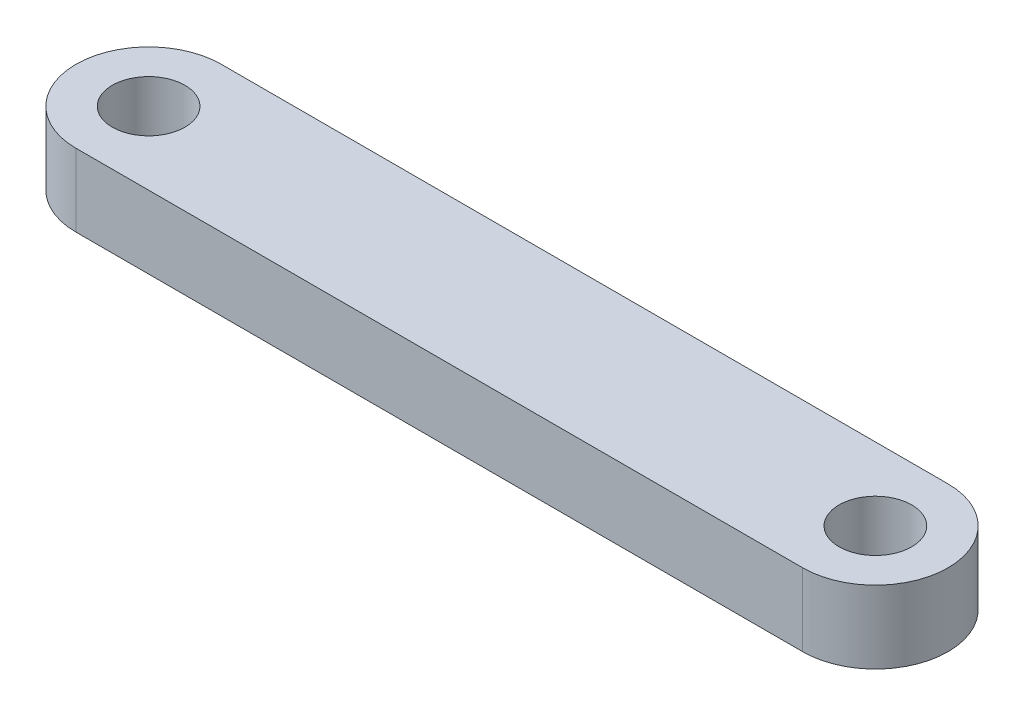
from build123d import *

# Parameters (mm, degrees)
SKETCH1_R           = 50
BOSS_EXTRUDE1_DEPTH = 50


with BuildPart() as part:
    # Sketch1 → Boss-Extrude1 (new, symmetric)
    with BuildSketch(Plane(origin=(0, 0, 0), x_dir=(1, 0, 0), z_dir=(0, 1, 0))):
        with BuildLine():
            Line((-500, 100), (500, 100))
            ThreePointArc((500, 100), (600, 0), (500, -100))
            Line((500, -100), (-500, -100))
            ThreePointArc((-500, -100), (-600, 0), (-500, 100))
        make_face()
        with Locations(Location((-500, 0, 0), (0, 0, 270))):
            Circle(SKETCH1_R, mode=Mode.SUBTRACT)
        with Locations(Location((500, 0, 0), (0, 0, 270))):
            Circle(SKETCH1_R, mode=Mode.SUBTRACT)
    extrude(amount=BOSS_EXTRUDE1_DEPTH, both=True)


solid = part.part
